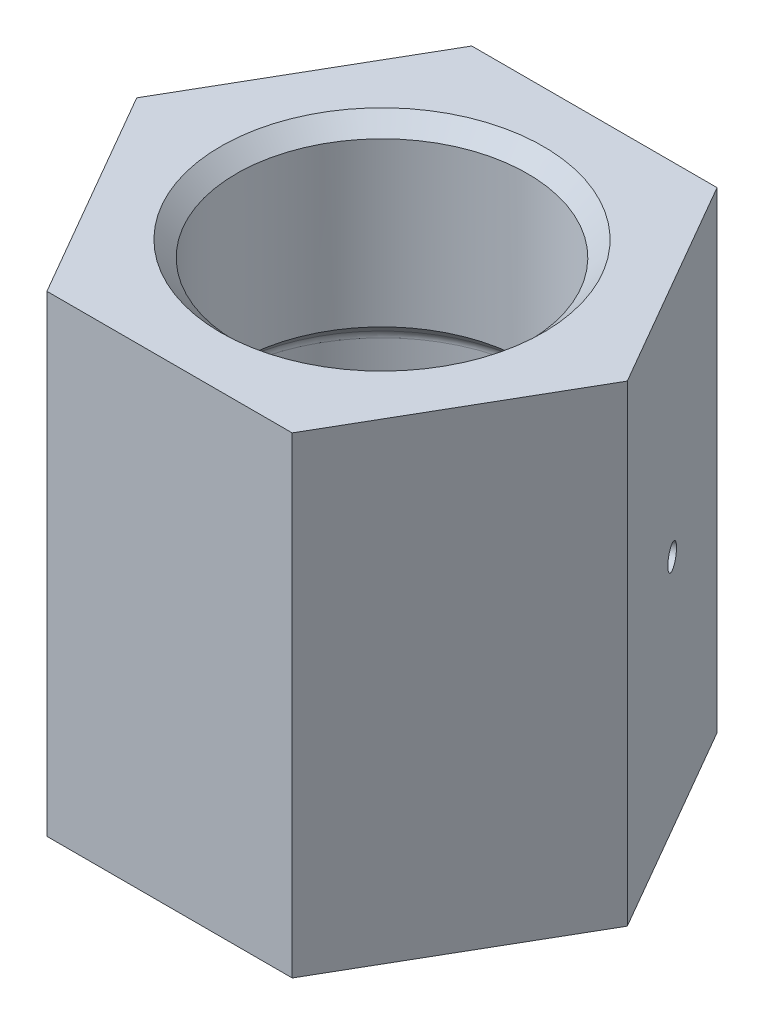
from build123d import *

# Parameters (mm, degrees)
P_IDAT_VYSUNUT_M1_DEPTH       = 30
M20X1_5_Z_VIT1_D              = 18.5
M20X1_5_Z_VIT1_DEPTH          = 47.5
M20X1_5_Z_VIT1_TIP            = 5.557960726
ZKOSEN_1_SIZE                 = 1
ZAOBLIT1_R                    = 0.75
ODEBRAT_VYSUNUT_M1_REACH      = 47.324
ODEBRAT_VYSUNUT_M1_END_RADIUS = 10.25
SKICA5_R                      = 0.75


with BuildPart() as part:
    # Skica1 → P_idat vysunut_m1 (new body)
    with BuildSketch(Plane(origin=(0, 0, 0), x_dir=(1, 0, 0), z_dir=(0, 1, 0))):
        Polygon((15.588457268, 0), (7.794228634, 13.5), (-7.794228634, 13.5), (-15.588457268, 0), (-7.794228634, -13.5), (7.794228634, -13.5), align=None)
    extrude(amount=P_IDAT_VYSUNUT_M1_DEPTH)

    # M20x1.5 z_vit1
    with Locations(Plane(origin=(0, 30, 0), x_dir=(-1, 0, 0), z_dir=(0, 1, 0))):
        with Locations((0, 0)):
            Hole(M20X1_5_Z_VIT1_D / 2, depth=M20X1_5_Z_VIT1_DEPTH)
            with Locations((0, 0, -(M20X1_5_Z_VIT1_DEPTH + M20X1_5_Z_VIT1_TIP / 2))):  # 118° drill point
                Cone(0, M20X1_5_Z_VIT1_D / 2, M20X1_5_Z_VIT1_TIP, mode=Mode.SUBTRACT)

    # Zkosen_1
    zkosen_1_edges = [part.edges().sort_by_distance(p)[0] for p in [
        (-9.25, 0, 0),
        (-9.25, 30, 0),
    ]]
    chamfer(zkosen_1_edges, length=ZKOSEN_1_SIZE)

    # Skica4 → Odebrat rotac_1 (revolve, cut)
    with BuildSketch(Plane.XY, mode=Mode.PRIVATE) as odebrat_rotac_1_sk:
        Polygon((-9.25, 12.649621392), (-10.25, 13.649621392), (-10.25, 17.649621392), (-9.25, 18.649621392), align=None)
    revolve(odebrat_rotac_1_sk.sketch.rotate(Axis((0, 0, 0), (0, 1, 0)), 90), axis=Axis((0, 0, 0), (0, 1, 0)), mode=Mode.SUBTRACT)

    # Zaoblit1
    zaoblit1_edges = [part.edges().sort_by_distance(p)[0] for p in [
        (0, 13.649621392, -10.25),
        (0, 17.649621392, -10.25),
    ]]
    fillet(zaoblit1_edges, radius=ZAOBLIT1_R)

    # Odebrat vysunut_m1: up to this cylinder (the profile starts outside it)
    odebrat_vysunut_m1_end = Plane(origin=(0, 15, 0), z_dir=(0, -1, 0)) * Cylinder(ODEBRAT_VYSUNUT_M1_END_RADIUS, 116.148, mode=Mode.PRIVATE)
    # Skica5 → Odebrat vysunut_m1 (cut, up to the surface)
    with BuildSketch(Plane(origin=(11.691342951, 0, -6.75), x_dir=(-0.4999999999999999, 0, -0.8660254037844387), z_dir=(0.8660254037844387, 0, -0.4999999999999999)), mode=Mode.PRIVATE) as odebrat_vysunut_m1_sk1:
        with Locations((0, 15)):
            Circle(SKICA5_R)
    odebrat_vysunut_m1_tool1 = extrude(odebrat_vysunut_m1_sk1.sketch, amount=-ODEBRAT_VYSUNUT_M1_REACH, mode=Mode.PRIVATE) - odebrat_vysunut_m1_end
    add(odebrat_vysunut_m1_tool1.solids().sort_by_distance((11.691343, 15, -6.75))[0], mode=Mode.SUBTRACT)


solid = part.part
